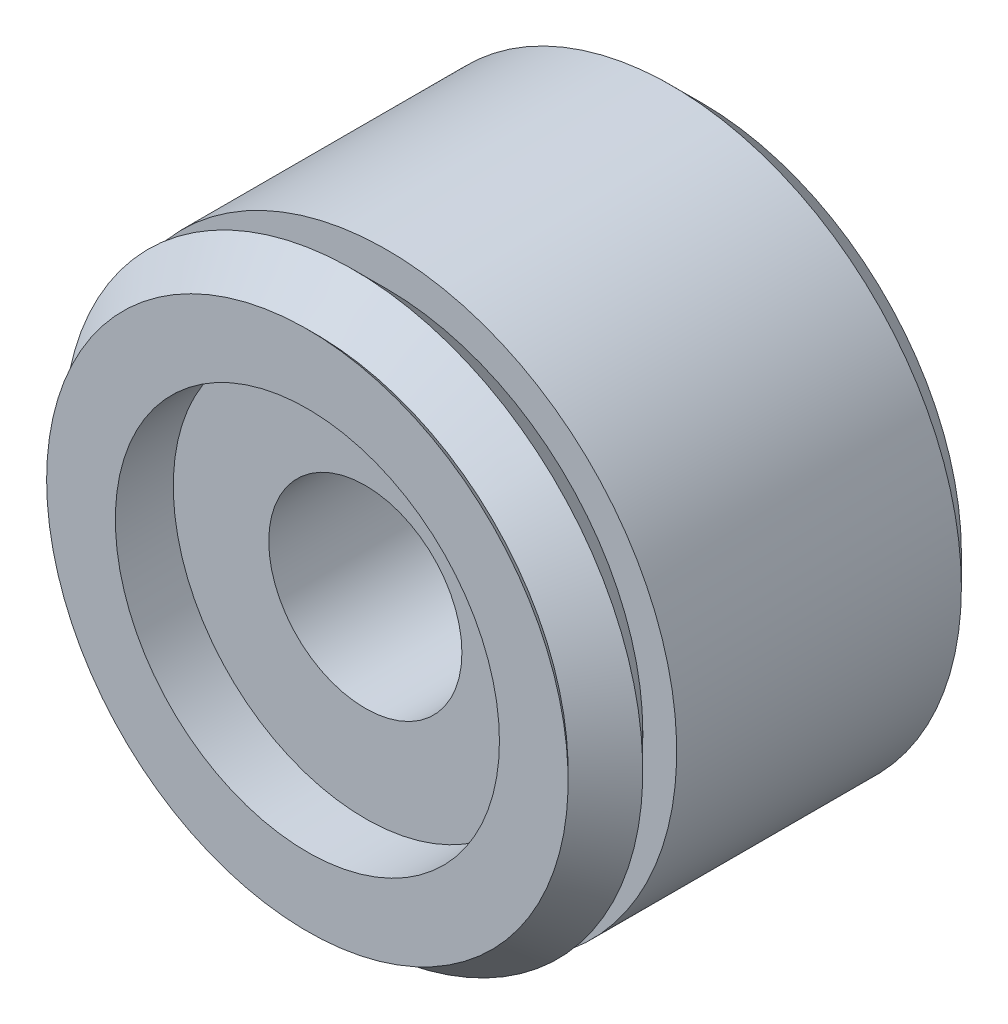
ISO-10303-21;
HEADER;
FILE_DESCRIPTION(('STEP AP214'),'2;1');
FILE_NAME('part.step','',(''),(''),'','','');
FILE_SCHEMA(('AUTOMOTIVE_DESIGN { 1 0 10303 214 1 1 1 1 }'));
ENDSEC;
DATA;
#1=APPLICATION_CONTEXT('core data for automotive mechanical design processes');
#2=APPLICATION_PROTOCOL_DEFINITION('international standard','automotive_design',2000,#1);
#3=PRODUCT_CONTEXT('',#1,'mechanical');
#4=PRODUCT('Part','Part','',(#3));
#5=PRODUCT_RELATED_PRODUCT_CATEGORY('part','',(#4));
#6=PRODUCT_DEFINITION_FORMATION('','',#4);
#7=PRODUCT_DEFINITION_CONTEXT('part definition',#1,'design');
#8=PRODUCT_DEFINITION('design','',#6,#7);
#9=PRODUCT_DEFINITION_SHAPE('','',#8);
#10=(LENGTH_UNIT() NAMED_UNIT(*) SI_UNIT(.MILLI.,.METRE.));
#11=(NAMED_UNIT(*) PLANE_ANGLE_UNIT() SI_UNIT($,.RADIAN.));
#12=(NAMED_UNIT(*) SI_UNIT($,.STERADIAN.) SOLID_ANGLE_UNIT());
#13=UNCERTAINTY_MEASURE_WITH_UNIT(LENGTH_MEASURE(1.E-05),#10,'distance_accuracy_value','');
#14=(GEOMETRIC_REPRESENTATION_CONTEXT(3) GLOBAL_UNCERTAINTY_ASSIGNED_CONTEXT((#13)) GLOBAL_UNIT_ASSIGNED_CONTEXT((#10,
#11,#12)) REPRESENTATION_CONTEXT('',''));
#15=CARTESIAN_POINT('',(0.,0.,0.));
#16=DIRECTION('',(0.,0.,1.));
#17=DIRECTION('',(1.,0.,0.));
#18=AXIS2_PLACEMENT_3D('',#15,#16,#17);
#19=CARTESIAN_POINT('',(0.,0.,-10.373614));
#20=DIRECTION('',(0.,0.,1.));
#21=DIRECTION('',(1.,0.,0.));
#22=AXIS2_PLACEMENT_3D('',#19,#20,#21);
#23=CYLINDRICAL_SURFACE('',#22,2.54);
#24=CARTESIAN_POINT('',(0.,0.,-10.373614));
#25=DIRECTION('',(0.,0.,-1.));
#26=DIRECTION('',(-1.,0.,0.));
#27=AXIS2_PLACEMENT_3D('',#24,#25,#26);
#28=CIRCLE('',#27,2.54);
#29=CARTESIAN_POINT('',(-2.54,0.,-10.373614));
#30=VERTEX_POINT('',#29);
#31=EDGE_CURVE('E62',#30,#30,#28,.T.);
#32=ORIENTED_EDGE('',*,*,#31,.T.);
#33=EDGE_LOOP('',(#32));
#34=FACE_BOUND('',#33,.T.);
#35=CARTESIAN_POINT('',(0.,0.,-1.524));
#36=DIRECTION('',(0.,0.,1.));
#37=DIRECTION('',(1.,0.,0.));
#38=AXIS2_PLACEMENT_3D('',#35,#36,#37);
#39=CIRCLE('',#38,2.54);
#40=CARTESIAN_POINT('',(2.54,0.,-1.524));
#41=VERTEX_POINT('',#40);
#42=EDGE_CURVE('E37',#41,#41,#39,.T.);
#43=ORIENTED_EDGE('',*,*,#42,.T.);
#44=EDGE_LOOP('',(#43));
#45=FACE_BOUND('',#44,.T.);
#46=ADVANCED_FACE('F33',(#34,#45),#23,.F.);
#47=CARTESIAN_POINT('',(0.,0.,0.));
#48=DIRECTION('',(0.,0.,1.));
#49=DIRECTION('',(1.,0.,0.));
#50=AXIS2_PLACEMENT_3D('',#47,#48,#49);
#51=PLANE('',#50);
#52=CARTESIAN_POINT('',(0.,0.,0.));
#53=DIRECTION('',(0.,0.,1.));
#54=DIRECTION('',(1.,0.,0.));
#55=AXIS2_PLACEMENT_3D('',#52,#53,#54);
#56=CIRCLE('',#55,5.05092480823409);
#57=CARTESIAN_POINT('',(5.05092480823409,0.,0.));
#58=VERTEX_POINT('',#57);
#59=EDGE_CURVE('E65',#58,#58,#56,.T.);
#60=ORIENTED_EDGE('',*,*,#59,.F.);
#61=EDGE_LOOP('',(#60));
#62=FACE_BOUND('',#61,.T.);
#63=CARTESIAN_POINT('',(0.,0.,0.));
#64=DIRECTION('',(0.,0.,-1.));
#65=DIRECTION('',(-1.,0.,0.));
#66=AXIS2_PLACEMENT_3D('',#63,#64,#65);
#67=CIRCLE('',#66,6.858);
#68=CARTESIAN_POINT('',(-6.858,0.,0.));
#69=VERTEX_POINT('',#68);
#70=EDGE_CURVE('E45',#69,#69,#67,.T.);
#71=ORIENTED_EDGE('',*,*,#70,.F.);
#72=EDGE_LOOP('',(#71));
#73=FACE_BOUND('',#72,.T.);
#74=ADVANCED_FACE('F86',(#62,#73),#51,.T.);
#75=CARTESIAN_POINT('',(0.,7.61999999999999,-10.373614));
#76=DIRECTION('',(0.,0.,-1.));
#77=DIRECTION('',(-1.,0.,0.));
#78=AXIS2_PLACEMENT_3D('',#75,#76,#77);
#79=PLANE('',#78);
#80=CARTESIAN_POINT('',(0.,0.,-10.373614));
#81=DIRECTION('',(0.,0.,-1.));
#82=DIRECTION('',(-1.,0.,0.));
#83=AXIS2_PLACEMENT_3D('',#80,#81,#82);
#84=CIRCLE('',#83,6.82625);
#85=CARTESIAN_POINT('',(6.82625,0.,-10.373614));
#86=VERTEX_POINT('',#85);
#87=EDGE_CURVE('E41',#86,#86,#84,.T.);
#88=ORIENTED_EDGE('',*,*,#87,.T.);
#89=EDGE_LOOP('',(#88));
#90=FACE_BOUND('',#89,.T.);
#91=ORIENTED_EDGE('',*,*,#31,.F.);
#92=EDGE_LOOP('',(#91));
#93=FACE_BOUND('',#92,.T.);
#94=ADVANCED_FACE('F92',(#90,#93),#79,.T.);
#95=CARTESIAN_POINT('',(0.,0.,-0.219709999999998));
#96=DIRECTION('',(0.,0.,1.));
#97=DIRECTION('',(1.,0.,0.));
#98=AXIS2_PLACEMENT_3D('',#95,#96,#97);
#99=CONICAL_SURFACE('',#98,6.63829,0.785398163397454);
#100=ORIENTED_EDGE('',*,*,#70,.T.);
#101=EDGE_LOOP('',(#100));
#102=FACE_BOUND('',#101,.T.);
#103=CARTESIAN_POINT('',(0.,0.,-0.219709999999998));
#104=DIRECTION('',(0.,0.,-1.));
#105=DIRECTION('',(-1.,0.,0.));
#106=AXIS2_PLACEMENT_3D('',#103,#104,#105);
#107=CIRCLE('',#106,6.63829);
#108=CARTESIAN_POINT('',(-6.63829,0.,-0.219709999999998));
#109=VERTEX_POINT('',#108);
#110=EDGE_CURVE('E50',#109,#109,#107,.T.);
#111=ORIENTED_EDGE('',*,*,#110,.F.);
#112=EDGE_LOOP('',(#111));
#113=FACE_BOUND('',#112,.T.);
#114=ADVANCED_FACE('F97',(#102,#113),#99,.T.);
#115=CARTESIAN_POINT('',(0.,0.,-1.20141999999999));
#116=DIRECTION('',(0.,0.,-1.));
#117=DIRECTION('',(-1.,0.,0.));
#118=AXIS2_PLACEMENT_3D('',#115,#116,#117);
#119=CONICAL_SURFACE('',#118,7.61999999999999,0.785398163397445);
#120=ORIENTED_EDGE('',*,*,#110,.T.);
#121=EDGE_LOOP('',(#120));
#122=FACE_BOUND('',#121,.T.);
#123=CARTESIAN_POINT('',(0.,0.,-1.20141999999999));
#124=DIRECTION('',(0.,0.,-1.));
#125=DIRECTION('',(-1.,0.,0.));
#126=AXIS2_PLACEMENT_3D('',#123,#124,#125);
#127=CIRCLE('',#126,7.61999999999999);
#128=CARTESIAN_POINT('',(-7.61999999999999,0.,-1.20141999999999));
#129=VERTEX_POINT('',#128);
#130=EDGE_CURVE('E53',#129,#129,#127,.T.);
#131=ORIENTED_EDGE('',*,*,#130,.F.);
#132=EDGE_LOOP('',(#131));
#133=FACE_BOUND('',#132,.T.);
#134=ADVANCED_FACE('F109',(#122,#133),#119,.T.);
#135=CARTESIAN_POINT('',(0.,0.,-2.093214));
#136=DIRECTION('',(0.,0.,1.));
#137=DIRECTION('',(1.,0.,0.));
#138=AXIS2_PLACEMENT_3D('',#135,#136,#137);
#139=CONICAL_SURFACE('',#138,6.72820599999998,0.785398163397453);
#140=ORIENTED_EDGE('',*,*,#130,.T.);
#141=EDGE_LOOP('',(#140));
#142=FACE_BOUND('',#141,.T.);
#143=CARTESIAN_POINT('',(0.,0.,-2.093214));
#144=DIRECTION('',(0.,0.,-1.));
#145=DIRECTION('',(-1.,0.,0.));
#146=AXIS2_PLACEMENT_3D('',#143,#144,#145);
#147=CIRCLE('',#146,6.72820599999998);
#148=CARTESIAN_POINT('',(-6.72820599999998,0.,-2.093214));
#149=VERTEX_POINT('',#148);
#150=EDGE_CURVE('E56',#149,#149,#147,.T.);
#151=ORIENTED_EDGE('',*,*,#150,.F.);
#152=EDGE_LOOP('',(#151));
#153=FACE_BOUND('',#152,.T.);
#154=ADVANCED_FACE('F105',(#142,#153),#139,.T.);
#155=CARTESIAN_POINT('',(0.,6.72820599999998,-2.093214));
#156=DIRECTION('',(0.,0.,1.));
#157=DIRECTION('',(1.,0.,0.));
#158=AXIS2_PLACEMENT_3D('',#155,#156,#157);
#159=PLANE('',#158);
#160=ORIENTED_EDGE('',*,*,#150,.T.);
#161=EDGE_LOOP('',(#160));
#162=FACE_BOUND('',#161,.T.);
#163=CARTESIAN_POINT('',(0.,0.,-2.093214));
#164=DIRECTION('',(0.,0.,-1.));
#165=DIRECTION('',(-1.,0.,0.));
#166=AXIS2_PLACEMENT_3D('',#163,#164,#165);
#167=CIRCLE('',#166,7.61999999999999);
#168=CARTESIAN_POINT('',(-7.61999999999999,0.,-2.093214));
#169=VERTEX_POINT('',#168);
#170=EDGE_CURVE('E59',#169,#169,#167,.T.);
#171=ORIENTED_EDGE('',*,*,#170,.F.);
#172=EDGE_LOOP('',(#171));
#173=FACE_BOUND('',#172,.T.);
#174=ADVANCED_FACE('F102',(#162,#173),#159,.T.);
#175=CARTESIAN_POINT('',(0.,0.,-71.2941240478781));
#176=DIRECTION('',(0.,0.,-1.));
#177=DIRECTION('',(-1.,0.,0.));
#178=AXIS2_PLACEMENT_3D('',#175,#176,#177);
#179=CYLINDRICAL_SURFACE('',#178,7.61999999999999);
#180=CARTESIAN_POINT('',(0.,0.,-9.579864));
#181=DIRECTION('',(0.,0.,-1.));
#182=DIRECTION('',(-1.,0.,0.));
#183=AXIS2_PLACEMENT_3D('',#180,#181,#182);
#184=CIRCLE('',#183,7.61999999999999);
#185=CARTESIAN_POINT('',(7.61999999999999,0.,-9.579864));
#186=VERTEX_POINT('',#185);
#187=EDGE_CURVE('E10',#186,#186,#184,.F.);
#188=ORIENTED_EDGE('',*,*,#187,.T.);
#189=EDGE_LOOP('',(#188));
#190=FACE_BOUND('',#189,.T.);
#191=ORIENTED_EDGE('',*,*,#170,.T.);
#192=EDGE_LOOP('',(#191));
#193=FACE_BOUND('',#192,.T.);
#194=ADVANCED_FACE('F99',(#190,#193),#179,.T.);
#195=CARTESIAN_POINT('',(0.,0.,-10.373614));
#196=DIRECTION('',(0.,0.,1.));
#197=DIRECTION('',(1.,0.,0.));
#198=AXIS2_PLACEMENT_3D('',#195,#196,#197);
#199=CONICAL_SURFACE('',#198,6.82625,0.785398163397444);
#200=CARTESIAN_POINT('',(7.61999999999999,0.,-9.579864));
#201=CARTESIAN_POINT('',(7.61173177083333,0.,-9.58813222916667));
#202=CARTESIAN_POINT('',(7.60346354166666,0.,-9.59640045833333));
#203=CARTESIAN_POINT('',(7.58692708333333,0.,-9.61293691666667));
#204=CARTESIAN_POINT('',(7.57865885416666,0.,-9.62120514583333));
#205=CARTESIAN_POINT('',(7.56212239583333,0.,-9.63774160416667));
#206=CARTESIAN_POINT('',(7.55385416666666,0.,-9.64600983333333));
#207=CARTESIAN_POINT('',(7.53731770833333,0.,-9.66254629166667));
#208=CARTESIAN_POINT('',(7.52904947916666,0.,-9.67081452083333));
#209=CARTESIAN_POINT('',(7.51251302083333,0.,-9.68735097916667));
#210=CARTESIAN_POINT('',(7.50424479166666,0.,-9.69561920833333));
#211=CARTESIAN_POINT('',(7.48770833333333,0.,-9.71215566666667));
#212=CARTESIAN_POINT('',(7.47944010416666,0.,-9.72042389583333));
#213=CARTESIAN_POINT('',(7.46290364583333,0.,-9.73696035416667));
#214=CARTESIAN_POINT('',(7.45463541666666,0.,-9.74522858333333));
#215=CARTESIAN_POINT('',(7.43809895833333,0.,-9.76176504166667));
#216=CARTESIAN_POINT('',(7.42983072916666,0.,-9.77003327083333));
#217=CARTESIAN_POINT('',(7.41329427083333,0.,-9.78656972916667));
#218=CARTESIAN_POINT('',(7.40502604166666,0.,-9.79483795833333));
#219=CARTESIAN_POINT('',(7.38848958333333,0.,-9.81137441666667));
#220=CARTESIAN_POINT('',(7.38022135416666,0.,-9.81964264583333));
#221=CARTESIAN_POINT('',(7.36368489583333,0.,-9.83617910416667));
#222=CARTESIAN_POINT('',(7.35541666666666,0.,-9.84444733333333));
#223=CARTESIAN_POINT('',(7.33888020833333,0.,-9.86098379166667));
#224=CARTESIAN_POINT('',(7.33061197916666,0.,-9.86925202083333));
#225=CARTESIAN_POINT('',(7.31407552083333,0.,-9.88578847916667));
#226=CARTESIAN_POINT('',(7.30580729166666,0.,-9.89405670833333));
#227=CARTESIAN_POINT('',(7.28927083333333,0.,-9.91059316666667));
#228=CARTESIAN_POINT('',(7.28100260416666,0.,-9.91886139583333));
#229=CARTESIAN_POINT('',(7.26446614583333,0.,-9.93539785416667));
#230=CARTESIAN_POINT('',(7.25619791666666,0.,-9.94366608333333));
#231=CARTESIAN_POINT('',(7.23966145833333,0.,-9.96020254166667));
#232=CARTESIAN_POINT('',(7.23139322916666,0.,-9.96847077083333));
#233=CARTESIAN_POINT('',(7.21485677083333,0.,-9.98500722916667));
#234=CARTESIAN_POINT('',(7.20658854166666,0.,-9.99327545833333));
#235=CARTESIAN_POINT('',(7.19005208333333,0.,-10.0098119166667));
#236=CARTESIAN_POINT('',(7.18178385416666,0.,-10.0180801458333));
#237=CARTESIAN_POINT('',(7.16524739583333,0.,-10.0346166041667));
#238=CARTESIAN_POINT('',(7.15697916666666,0.,-10.0428848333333));
#239=CARTESIAN_POINT('',(7.14044270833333,0.,-10.0594212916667));
#240=CARTESIAN_POINT('',(7.13217447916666,0.,-10.0676895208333));
#241=CARTESIAN_POINT('',(7.11563802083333,0.,-10.0842259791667));
#242=CARTESIAN_POINT('',(7.10736979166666,0.,-10.0924942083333));
#243=CARTESIAN_POINT('',(7.09083333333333,0.,-10.1090306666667));
#244=CARTESIAN_POINT('',(7.08256510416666,0.,-10.1172988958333));
#245=CARTESIAN_POINT('',(7.06602864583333,0.,-10.1338353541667));
#246=CARTESIAN_POINT('',(7.05776041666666,0.,-10.1421035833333));
#247=CARTESIAN_POINT('',(7.04122395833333,0.,-10.1586400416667));
#248=CARTESIAN_POINT('',(7.03295572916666,0.,-10.1669082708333));
#249=CARTESIAN_POINT('',(7.01641927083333,0.,-10.1834447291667));
#250=CARTESIAN_POINT('',(7.00815104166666,0.,-10.1917129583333));
#251=CARTESIAN_POINT('',(6.99161458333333,0.,-10.2082494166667));
#252=CARTESIAN_POINT('',(6.98334635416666,0.,-10.2165176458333));
#253=CARTESIAN_POINT('',(6.96680989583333,0.,-10.2330541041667));
#254=CARTESIAN_POINT('',(6.95854166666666,0.,-10.2413223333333));
#255=CARTESIAN_POINT('',(6.94200520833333,0.,-10.2578587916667));
#256=CARTESIAN_POINT('',(6.93373697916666,0.,-10.2661270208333));
#257=CARTESIAN_POINT('',(6.91720052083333,0.,-10.2826634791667));
#258=CARTESIAN_POINT('',(6.90893229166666,0.,-10.2909317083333));
#259=CARTESIAN_POINT('',(6.89239583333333,0.,-10.3074681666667));
#260=CARTESIAN_POINT('',(6.88412760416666,0.,-10.3157363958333));
#261=CARTESIAN_POINT('',(6.86759114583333,0.,-10.3322728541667));
#262=CARTESIAN_POINT('',(6.85932291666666,0.,-10.3405410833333));
#263=CARTESIAN_POINT('',(6.84278645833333,0.,-10.3570775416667));
#264=CARTESIAN_POINT('',(6.83451822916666,0.,-10.3653457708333));
#265=CARTESIAN_POINT('',(6.82625,0.,-10.373614));
#266=B_SPLINE_CURVE_WITH_KNOTS('',3,(#200,#201,#202,#203,#204,#205,#206,#207,#208,#209,#210,
#211,#212,#213,#214,#215,#216,#217,#218,#219,#220,#221,#222,#223,#224,#225,#226,#227,#228,#229,
#230,#231,#232,#233,#234,#235,#236,#237,#238,#239,#240,#241,#242,#243,#244,#245,#246,#247,#248,
#249,#250,#251,#252,#253,#254,#255,#256,#257,#258,#259,#260,#261,#262,#263,#264,#265),
.UNSPECIFIED.,.F.,.F.,(4,2,2,2,2,2,2,2,2,2,2,2,2,2,2,2,2,2,2,2,2,2,2,2,2,2,2,2,2,2,2,2,4),(0.,
0.0350791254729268,0.070158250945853,0.10523737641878,0.140316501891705,0.175395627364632,
0.210474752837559,0.245553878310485,0.28063300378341,0.315712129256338,0.350791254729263,
0.385870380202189,0.420949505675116,0.456028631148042,0.491107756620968,0.526186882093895,
0.561266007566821,0.596345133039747,0.631424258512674,0.6665033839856,0.701582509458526,
0.736661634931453,0.771740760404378,0.806819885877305,0.841899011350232,0.876978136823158,
0.912057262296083,0.947136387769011,0.982215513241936,1.01729463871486,1.05237376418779,
1.08745288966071,1.12253201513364),.UNSPECIFIED.);
#267=EDGE_CURVE('BSEAM35',#186,#86,#266,.T.);
#268=ORIENTED_EDGE('',*,*,#187,.F.);
#269=ORIENTED_EDGE('',*,*,#87,.F.);
#270=ORIENTED_EDGE('',*,*,#267,.T.);
#271=ORIENTED_EDGE('',*,*,#267,.F.);
#272=EDGE_LOOP('',(#268,#270,#269,#271));
#273=FACE_BOUND('',#272,.T.);
#274=ADVANCED_FACE('F35',(#273),#199,.T.);
#275=CARTESIAN_POINT('',(0.,0.,-1.524));
#276=DIRECTION('',(0.,0.,1.));
#277=DIRECTION('',(1.,0.,0.));
#278=AXIS2_PLACEMENT_3D('',#275,#276,#277);
#279=CYLINDRICAL_SURFACE('',#278,5.05092480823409);
#280=CARTESIAN_POINT('',(0.,0.,-1.524));
#281=DIRECTION('',(0.,0.,1.));
#282=DIRECTION('',(1.,0.,0.));
#283=AXIS2_PLACEMENT_3D('',#280,#281,#282);
#284=CIRCLE('',#283,5.05092480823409);
#285=CARTESIAN_POINT('',(5.05092480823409,0.,-1.524));
#286=VERTEX_POINT('',#285);
#287=EDGE_CURVE('E68',#286,#286,#284,.T.);
#288=ORIENTED_EDGE('',*,*,#287,.F.);
#289=EDGE_LOOP('',(#288));
#290=FACE_BOUND('',#289,.T.);
#291=ORIENTED_EDGE('',*,*,#59,.T.);
#292=EDGE_LOOP('',(#291));
#293=FACE_BOUND('',#292,.T.);
#294=ADVANCED_FACE('F78',(#290,#293),#279,.F.);
#295=CARTESIAN_POINT('',(0.,0.,-1.524));
#296=DIRECTION('',(0.,0.,1.));
#297=DIRECTION('',(1.,0.,0.));
#298=AXIS2_PLACEMENT_3D('',#295,#296,#297);
#299=PLANE('',#298);
#300=ORIENTED_EDGE('',*,*,#42,.F.);
#301=EDGE_LOOP('',(#300));
#302=FACE_BOUND('',#301,.T.);
#303=ORIENTED_EDGE('',*,*,#287,.T.);
#304=EDGE_LOOP('',(#303));
#305=FACE_BOUND('',#304,.T.);
#306=ADVANCED_FACE('F76',(#302,#305),#299,.T.);
#307=CLOSED_SHELL('',(#46,#74,#94,#114,#134,#154,#174,#194,#274,#294,#306));
#308=MANIFOLD_SOLID_BREP('B2',#307);
#309=ADVANCED_BREP_SHAPE_REPRESENTATION('',(#18,#308),#14);
#310=SHAPE_DEFINITION_REPRESENTATION(#9,#309);
ENDSEC;
END-ISO-10303-21;
